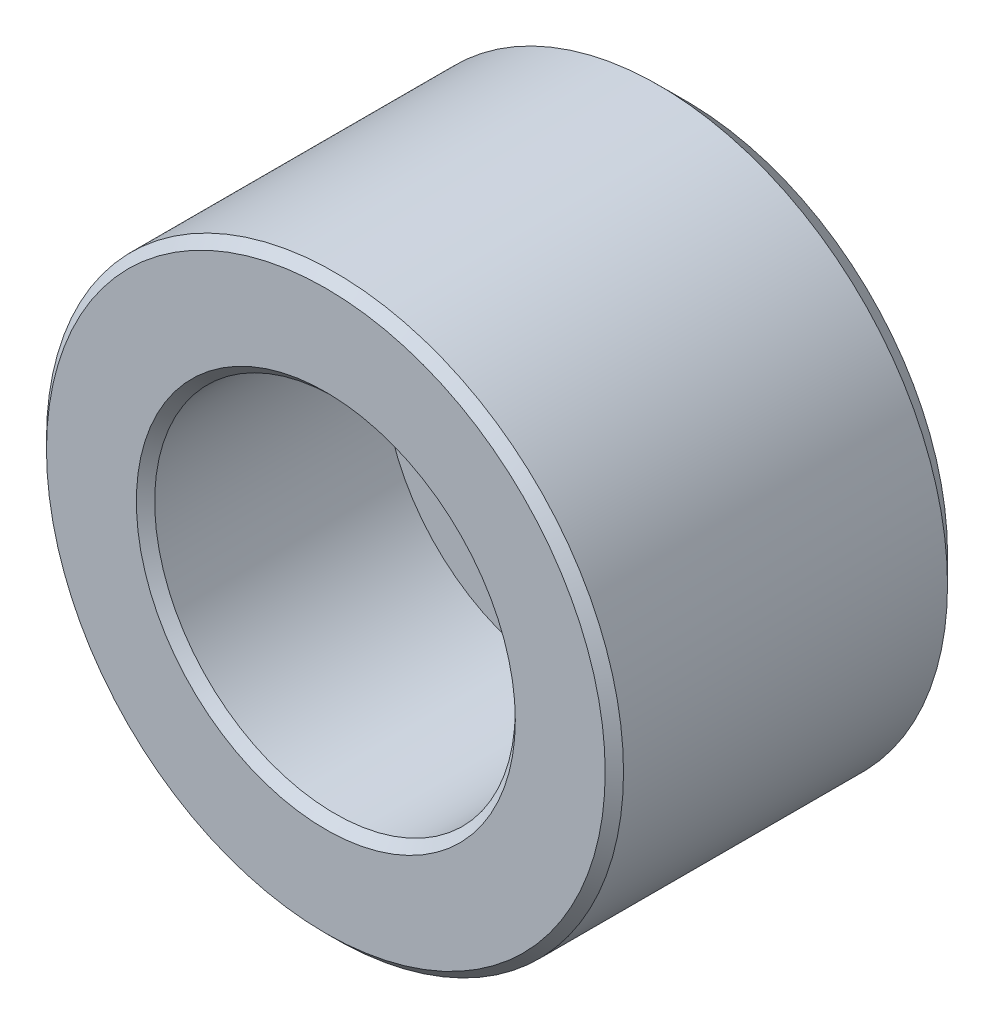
ISO-10303-21;
HEADER;
FILE_DESCRIPTION(('STEP AP214'),'2;1');
FILE_NAME('part.step','',(''),(''),'','','');
FILE_SCHEMA(('AUTOMOTIVE_DESIGN { 1 0 10303 214 1 1 1 1 }'));
ENDSEC;
DATA;
#1=APPLICATION_CONTEXT('core data for automotive mechanical design processes');
#2=APPLICATION_PROTOCOL_DEFINITION('international standard','automotive_design',2000,#1);
#3=PRODUCT_CONTEXT('',#1,'mechanical');
#4=PRODUCT('Part','Part','',(#3));
#5=PRODUCT_RELATED_PRODUCT_CATEGORY('part','',(#4));
#6=PRODUCT_DEFINITION_FORMATION('','',#4);
#7=PRODUCT_DEFINITION_CONTEXT('part definition',#1,'design');
#8=PRODUCT_DEFINITION('design','',#6,#7);
#9=PRODUCT_DEFINITION_SHAPE('','',#8);
#10=(LENGTH_UNIT() NAMED_UNIT(*) SI_UNIT(.MILLI.,.METRE.));
#11=(NAMED_UNIT(*) PLANE_ANGLE_UNIT() SI_UNIT($,.RADIAN.));
#12=(NAMED_UNIT(*) SI_UNIT($,.STERADIAN.) SOLID_ANGLE_UNIT());
#13=UNCERTAINTY_MEASURE_WITH_UNIT(LENGTH_MEASURE(1.E-05),#10,'distance_accuracy_value','');
#14=(GEOMETRIC_REPRESENTATION_CONTEXT(3) GLOBAL_UNCERTAINTY_ASSIGNED_CONTEXT((#13)) GLOBAL_UNIT_ASSIGNED_CONTEXT((#10,
#11,#12)) REPRESENTATION_CONTEXT('',''));
#15=CARTESIAN_POINT('',(0.,0.,0.));
#16=DIRECTION('',(0.,0.,1.));
#17=DIRECTION('',(1.,0.,0.));
#18=AXIS2_PLACEMENT_3D('',#15,#16,#17);
#19=CARTESIAN_POINT('',(0.,0.,10.));
#20=DIRECTION('',(0.,0.,1.));
#21=DIRECTION('',(1.,0.,0.));
#22=AXIS2_PLACEMENT_3D('',#19,#20,#21);
#23=CYLINDRICAL_SURFACE('',#22,2.75);
#24=CARTESIAN_POINT('',(0.,0.,0.2599));
#25=DIRECTION('',(0.,0.,1.));
#26=DIRECTION('',(1.,0.,0.));
#27=AXIS2_PLACEMENT_3D('',#24,#25,#26);
#28=CIRCLE('',#27,2.75);
#29=CARTESIAN_POINT('',(2.75,0.,0.2599));
#30=VERTEX_POINT('',#29);
#31=EDGE_CURVE('E32',#30,#30,#28,.T.);
#32=ORIENTED_EDGE('',*,*,#31,.F.);
#33=EDGE_LOOP('',(#32));
#34=FACE_BOUND('',#33,.T.);
#35=CARTESIAN_POINT('',(0.,0.,3.396));
#36=DIRECTION('',(0.,0.,1.));
#37=DIRECTION('',(1.,0.,0.));
#38=AXIS2_PLACEMENT_3D('',#35,#36,#37);
#39=CIRCLE('',#38,2.75);
#40=CARTESIAN_POINT('',(2.75,0.,3.396));
#41=VERTEX_POINT('',#40);
#42=EDGE_CURVE('E30',#41,#41,#39,.F.);
#43=ORIENTED_EDGE('',*,*,#42,.F.);
#44=EDGE_LOOP('',(#43));
#45=FACE_BOUND('',#44,.T.);
#46=ADVANCED_FACE('F12',(#34,#45),#23,.F.);
#47=CARTESIAN_POINT('',(0.,0.,0.));
#48=DIRECTION('',(0.,0.,1.));
#49=DIRECTION('',(1.,0.,0.));
#50=AXIS2_PLACEMENT_3D('',#47,#48,#49);
#51=CYLINDRICAL_SURFACE('',#50,8.);
#52=CARTESIAN_POINT('',(0.,0.,0.762));
#53=DIRECTION('',(0.,0.,1.));
#54=DIRECTION('',(1.,0.,0.));
#55=AXIS2_PLACEMENT_3D('',#52,#53,#54);
#56=CIRCLE('',#55,8.);
#57=CARTESIAN_POINT('',(8.,0.,0.762));
#58=VERTEX_POINT('',#57);
#59=EDGE_CURVE('E27',#58,#58,#56,.T.);
#60=ORIENTED_EDGE('',*,*,#59,.T.);
#61=EDGE_LOOP('',(#60));
#62=FACE_BOUND('',#61,.T.);
#63=CARTESIAN_POINT('',(0.,0.,9.746));
#64=DIRECTION('',(0.,0.,1.));
#65=DIRECTION('',(1.,0.,0.));
#66=AXIS2_PLACEMENT_3D('',#63,#64,#65);
#67=CIRCLE('',#66,8.);
#68=CARTESIAN_POINT('',(8.,0.,9.746));
#69=VERTEX_POINT('',#68);
#70=EDGE_CURVE('E37',#69,#69,#67,.F.);
#71=ORIENTED_EDGE('',*,*,#70,.T.);
#72=EDGE_LOOP('',(#71));
#73=FACE_BOUND('',#72,.T.);
#74=ADVANCED_FACE('F68',(#62,#73),#51,.T.);
#75=CARTESIAN_POINT('',(0.,0.,0.));
#76=DIRECTION('',(0.,0.,1.));
#77=DIRECTION('',(1.,0.,0.));
#78=AXIS2_PLACEMENT_3D('',#75,#76,#77);
#79=PLANE('',#78);
#80=CARTESIAN_POINT('',(0.,0.,0.));
#81=DIRECTION('',(0.,0.,1.));
#82=DIRECTION('',(1.,0.,0.));
#83=AXIS2_PLACEMENT_3D('',#80,#81,#82);
#84=CIRCLE('',#83,3.0099);
#85=CARTESIAN_POINT('',(3.0099,0.,0.));
#86=VERTEX_POINT('',#85);
#87=EDGE_CURVE('E43',#86,#86,#84,.T.);
#88=ORIENTED_EDGE('',*,*,#87,.T.);
#89=EDGE_LOOP('',(#88));
#90=FACE_BOUND('',#89,.T.);
#91=CARTESIAN_POINT('',(0.,0.,0.));
#92=DIRECTION('',(0.,0.,1.));
#93=DIRECTION('',(1.,0.,0.));
#94=AXIS2_PLACEMENT_3D('',#91,#92,#93);
#95=CIRCLE('',#94,7.238);
#96=CARTESIAN_POINT('',(7.238,0.,0.));
#97=VERTEX_POINT('',#96);
#98=EDGE_CURVE('E23',#97,#97,#95,.F.);
#99=ORIENTED_EDGE('',*,*,#98,.T.);
#100=EDGE_LOOP('',(#99));
#101=FACE_BOUND('',#100,.T.);
#102=ADVANCED_FACE('F74',(#90,#101),#79,.F.);
#103=CARTESIAN_POINT('',(0.,0.,10.));
#104=DIRECTION('',(0.,0.,1.));
#105=DIRECTION('',(1.,0.,0.));
#106=AXIS2_PLACEMENT_3D('',#103,#104,#105);
#107=PLANE('',#106);
#108=CARTESIAN_POINT('',(0.,0.,10.));
#109=DIRECTION('',(0.,0.,1.));
#110=DIRECTION('',(1.,0.,0.));
#111=AXIS2_PLACEMENT_3D('',#108,#109,#110);
#112=CIRCLE('',#111,5.254);
#113=CARTESIAN_POINT('',(5.254,0.,10.));
#114=VERTEX_POINT('',#113);
#115=EDGE_CURVE('E8',#114,#114,#112,.F.);
#116=ORIENTED_EDGE('',*,*,#115,.T.);
#117=EDGE_LOOP('',(#116));
#118=FACE_BOUND('',#117,.T.);
#119=CARTESIAN_POINT('',(0.,0.,10.));
#120=DIRECTION('',(0.,0.,1.));
#121=DIRECTION('',(1.,0.,0.));
#122=AXIS2_PLACEMENT_3D('',#119,#120,#121);
#123=CIRCLE('',#122,7.746);
#124=CARTESIAN_POINT('',(7.746,0.,10.));
#125=VERTEX_POINT('',#124);
#126=EDGE_CURVE('E40',#125,#125,#123,.T.);
#127=ORIENTED_EDGE('',*,*,#126,.T.);
#128=EDGE_LOOP('',(#127));
#129=FACE_BOUND('',#128,.T.);
#130=ADVANCED_FACE('F86',(#118,#129),#107,.T.);
#131=CARTESIAN_POINT('',(0.,0.,10.));
#132=DIRECTION('',(0.,0.,-1.));
#133=DIRECTION('',(-1.,0.,0.));
#134=AXIS2_PLACEMENT_3D('',#131,#132,#133);
#135=CONICAL_SURFACE('',#134,7.746,0.785398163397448);
#136=ORIENTED_EDGE('',*,*,#70,.F.);
#137=EDGE_LOOP('',(#136));
#138=FACE_BOUND('',#137,.T.);
#139=ORIENTED_EDGE('',*,*,#126,.F.);
#140=EDGE_LOOP('',(#139));
#141=FACE_BOUND('',#140,.T.);
#142=ADVANCED_FACE('F89',(#138,#141),#135,.T.);
#143=CARTESIAN_POINT('',(0.,0.,0.762));
#144=DIRECTION('',(0.,0.,1.));
#145=DIRECTION('',(1.,0.,0.));
#146=AXIS2_PLACEMENT_3D('',#143,#144,#145);
#147=CONICAL_SURFACE('',#146,8.,0.785398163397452);
#148=ORIENTED_EDGE('',*,*,#98,.F.);
#149=EDGE_LOOP('',(#148));
#150=FACE_BOUND('',#149,.T.);
#151=ORIENTED_EDGE('',*,*,#59,.F.);
#152=EDGE_LOOP('',(#151));
#153=FACE_BOUND('',#152,.T.);
#154=ADVANCED_FACE('F82',(#150,#153),#147,.T.);
#155=CARTESIAN_POINT('',(0.,0.,0.2599));
#156=DIRECTION('',(0.,0.,-1.));
#157=DIRECTION('',(-1.,0.,0.));
#158=AXIS2_PLACEMENT_3D('',#155,#156,#157);
#159=CONICAL_SURFACE('',#158,2.75,0.785398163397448);
#160=ORIENTED_EDGE('',*,*,#87,.F.);
#161=EDGE_LOOP('',(#160));
#162=FACE_BOUND('',#161,.T.);
#163=ORIENTED_EDGE('',*,*,#31,.T.);
#164=EDGE_LOOP('',(#163));
#165=FACE_BOUND('',#164,.T.);
#166=ADVANCED_FACE('F64',(#162,#165),#159,.F.);
#167=CARTESIAN_POINT('',(0.,0.,3.396));
#168=DIRECTION('',(0.,0.,1.));
#169=DIRECTION('',(1.,0.,0.));
#170=AXIS2_PLACEMENT_3D('',#167,#168,#169);
#171=PLANE('',#170);
#172=CARTESIAN_POINT('',(0.,0.,3.396));
#173=DIRECTION('',(0.,0.,1.));
#174=DIRECTION('',(1.,0.,0.));
#175=AXIS2_PLACEMENT_3D('',#172,#173,#174);
#176=CIRCLE('',#175,5.);
#177=CARTESIAN_POINT('',(5.,0.,3.396));
#178=VERTEX_POINT('',#177);
#179=EDGE_CURVE('E33',#178,#178,#176,.T.);
#180=ORIENTED_EDGE('',*,*,#179,.T.);
#181=EDGE_LOOP('',(#180));
#182=FACE_BOUND('',#181,.T.);
#183=ORIENTED_EDGE('',*,*,#42,.T.);
#184=EDGE_LOOP('',(#183));
#185=FACE_BOUND('',#184,.T.);
#186=ADVANCED_FACE('F51',(#182,#185),#171,.T.);
#187=CARTESIAN_POINT('',(0.,0.,3.396));
#188=DIRECTION('',(0.,0.,1.));
#189=DIRECTION('',(1.,0.,0.));
#190=AXIS2_PLACEMENT_3D('',#187,#188,#189);
#191=CYLINDRICAL_SURFACE('',#190,5.);
#192=CARTESIAN_POINT('',(0.,0.,9.746));
#193=DIRECTION('',(0.,0.,1.));
#194=DIRECTION('',(1.,0.,0.));
#195=AXIS2_PLACEMENT_3D('',#192,#193,#194);
#196=CIRCLE('',#195,5.);
#197=CARTESIAN_POINT('',(5.,0.,9.746));
#198=VERTEX_POINT('',#197);
#199=EDGE_CURVE('E19',#198,#198,#196,.T.);
#200=ORIENTED_EDGE('',*,*,#199,.T.);
#201=EDGE_LOOP('',(#200));
#202=FACE_BOUND('',#201,.T.);
#203=ORIENTED_EDGE('',*,*,#179,.F.);
#204=EDGE_LOOP('',(#203));
#205=FACE_BOUND('',#204,.T.);
#206=ADVANCED_FACE('F54',(#202,#205),#191,.F.);
#207=CARTESIAN_POINT('',(0.,0.,9.746));
#208=DIRECTION('',(0.,0.,1.));
#209=DIRECTION('',(1.,0.,0.));
#210=AXIS2_PLACEMENT_3D('',#207,#208,#209);
#211=CONICAL_SURFACE('',#210,5.,0.78539816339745);
#212=ORIENTED_EDGE('',*,*,#115,.F.);
#213=EDGE_LOOP('',(#212));
#214=FACE_BOUND('',#213,.T.);
#215=ORIENTED_EDGE('',*,*,#199,.F.);
#216=EDGE_LOOP('',(#215));
#217=FACE_BOUND('',#216,.T.);
#218=ADVANCED_FACE('F14',(#214,#217),#211,.F.);
#219=CLOSED_SHELL('',(#46,#74,#102,#130,#142,#154,#166,#186,#206,#218));
#220=MANIFOLD_SOLID_BREP('B1',#219);
#221=ADVANCED_BREP_SHAPE_REPRESENTATION('',(#18,#220),#14);
#222=SHAPE_DEFINITION_REPRESENTATION(#9,#221);
ENDSEC;
END-ISO-10303-21;
